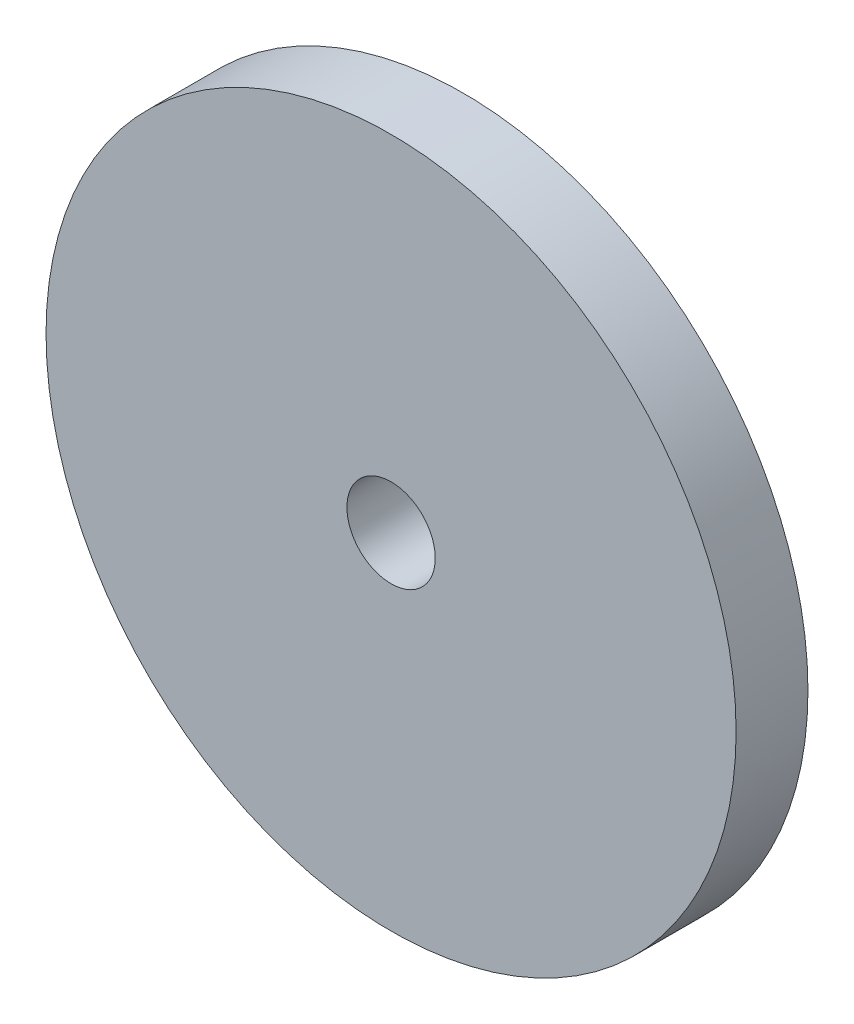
from build123d import *

# Parameters (mm, degrees)
SKETCH1_R           = 25
SKETCH1_R_2         = 3.2
BOSS_EXTRUDE1_DEPTH = 5.2059


with BuildPart() as part:
    # Sketch1 → Boss-Extrude1 (new body)
    with BuildSketch(Plane.XY):
        Circle(SKETCH1_R)
        Circle(SKETCH1_R_2, mode=Mode.SUBTRACT)
    extrude(amount=BOSS_EXTRUDE1_DEPTH)


solid = part.part
